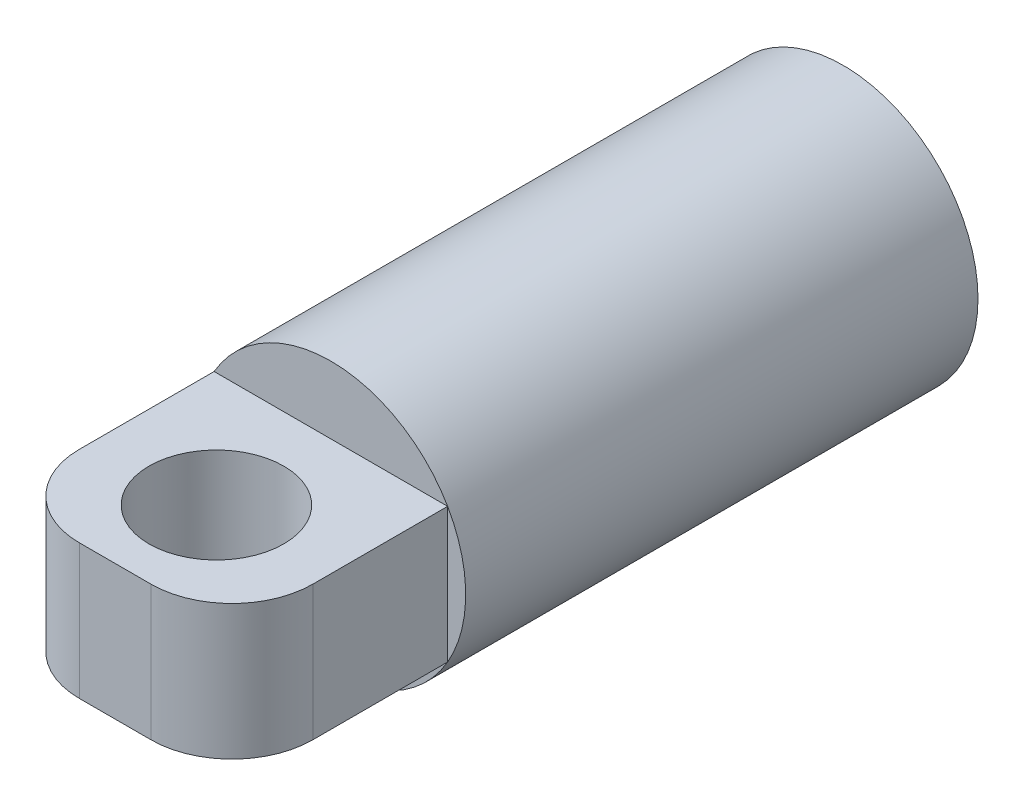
ISO-10303-21;
HEADER;
FILE_DESCRIPTION(('STEP AP214'),'2;1');
FILE_NAME('part.step','',(''),(''),'','','');
FILE_SCHEMA(('AUTOMOTIVE_DESIGN { 1 0 10303 214 1 1 1 1 }'));
ENDSEC;
DATA;
#1=APPLICATION_CONTEXT('core data for automotive mechanical design processes');
#2=APPLICATION_PROTOCOL_DEFINITION('international standard','automotive_design',2000,#1);
#3=PRODUCT_CONTEXT('',#1,'mechanical');
#4=PRODUCT('Part','Part','',(#3));
#5=PRODUCT_RELATED_PRODUCT_CATEGORY('part','',(#4));
#6=PRODUCT_DEFINITION_FORMATION('','',#4);
#7=PRODUCT_DEFINITION_CONTEXT('part definition',#1,'design');
#8=PRODUCT_DEFINITION('design','',#6,#7);
#9=PRODUCT_DEFINITION_SHAPE('','',#8);
#10=(LENGTH_UNIT() NAMED_UNIT(*) SI_UNIT(.MILLI.,.METRE.));
#11=(NAMED_UNIT(*) PLANE_ANGLE_UNIT() SI_UNIT($,.RADIAN.));
#12=(NAMED_UNIT(*) SI_UNIT($,.STERADIAN.) SOLID_ANGLE_UNIT());
#13=UNCERTAINTY_MEASURE_WITH_UNIT(LENGTH_MEASURE(1.E-05),#10,'distance_accuracy_value','');
#14=(GEOMETRIC_REPRESENTATION_CONTEXT(3) GLOBAL_UNCERTAINTY_ASSIGNED_CONTEXT((#13)) GLOBAL_UNIT_ASSIGNED_CONTEXT((#10,
#11,#12)) REPRESENTATION_CONTEXT('',''));
#15=CARTESIAN_POINT('',(0.,0.,0.));
#16=DIRECTION('',(0.,0.,1.));
#17=DIRECTION('',(1.,0.,0.));
#18=AXIS2_PLACEMENT_3D('',#15,#16,#17);
#19=CARTESIAN_POINT('',(0.,0.,27.));
#20=DIRECTION('',(0.,0.,-1.));
#21=DIRECTION('',(-1.,0.,0.));
#22=AXIS2_PLACEMENT_3D('',#19,#20,#21);
#23=CYLINDRICAL_SURFACE('',#22,5.);
#24=CARTESIAN_POINT('',(0.,0.,0.));
#25=DIRECTION('',(0.,0.,1.));
#26=DIRECTION('',(1.,0.,0.));
#27=AXIS2_PLACEMENT_3D('',#24,#25,#26);
#28=CIRCLE('',#27,5.);
#29=CARTESIAN_POINT('',(5.,0.,0.));
#30=VERTEX_POINT('',#29);
#31=EDGE_CURVE('E130',#30,#30,#28,.T.);
#32=ORIENTED_EDGE('',*,*,#31,.T.);
#33=EDGE_LOOP('',(#32));
#34=FACE_BOUND('',#33,.T.);
#35=CARTESIAN_POINT('',(0.,0.,19.));
#36=DIRECTION('',(0.,0.,1.));
#37=DIRECTION('',(1.,0.,0.));
#38=AXIS2_PLACEMENT_3D('',#35,#36,#37);
#39=CIRCLE('',#38,5.);
#40=CARTESIAN_POINT('',(4.33012701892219,2.5,19.));
#41=VERTEX_POINT('',#40);
#42=CARTESIAN_POINT('',(-4.33012701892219,2.5,19.));
#43=VERTEX_POINT('',#42);
#44=EDGE_CURVE('E98',#41,#43,#39,.T.);
#45=ORIENTED_EDGE('',*,*,#44,.F.);
#46=CARTESIAN_POINT('',(4.3301270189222,-2.5,19.));
#47=VERTEX_POINT('',#46);
#48=EDGE_CURVE('E90',#47,#41,#39,.T.);
#49=ORIENTED_EDGE('',*,*,#48,.F.);
#50=CARTESIAN_POINT('',(-4.33012701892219,-2.5,19.));
#51=VERTEX_POINT('',#50);
#52=EDGE_CURVE('E99',#51,#47,#39,.T.);
#53=ORIENTED_EDGE('',*,*,#52,.F.);
#54=EDGE_CURVE('E124',#43,#51,#39,.T.);
#55=ORIENTED_EDGE('',*,*,#54,.F.);
#56=EDGE_LOOP('',(#45,#49,#53,#55));
#57=FACE_BOUND('',#56,.T.);
#58=ADVANCED_FACE('F34',(#34,#57),#23,.T.);
#59=CARTESIAN_POINT('',(0.,0.,0.));
#60=DIRECTION('',(0.,0.,1.));
#61=DIRECTION('',(1.,0.,0.));
#62=AXIS2_PLACEMENT_3D('',#59,#60,#61);
#63=PLANE('',#62);
#64=ORIENTED_EDGE('',*,*,#31,.F.);
#65=EDGE_LOOP('',(#64));
#66=FACE_BOUND('',#65,.T.);
#67=ADVANCED_FACE('F173',(#66),#63,.F.);
#68=CARTESIAN_POINT('',(0.,0.,19.));
#69=DIRECTION('',(0.,0.,1.));
#70=DIRECTION('',(1.,0.,0.));
#71=AXIS2_PLACEMENT_3D('',#68,#69,#70);
#72=PLANE('',#71);
#73=ORIENTED_EDGE('',*,*,#44,.T.);
#74=DIRECTION('',(-1.,0.,0.));
#75=VECTOR('',#74,1.);
#76=CARTESIAN_POINT('',(-4.33012701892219,2.5,19.));
#77=LINE('',#76,#75);
#78=EDGE_CURVE('E108',#41,#43,#77,.T.);
#79=ORIENTED_EDGE('',*,*,#78,.F.);
#80=EDGE_LOOP('',(#73,#79));
#81=FACE_BOUND('',#80,.T.);
#82=ADVANCED_FACE('F115',(#81),#72,.T.);
#83=ORIENTED_EDGE('',*,*,#54,.T.);
#84=DIRECTION('',(0.,-1.,0.));
#85=VECTOR('',#84,1.);
#86=CARTESIAN_POINT('',(-4.33012701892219,-2.5,19.));
#87=LINE('',#86,#85);
#88=EDGE_CURVE('E117',#43,#51,#87,.T.);
#89=ORIENTED_EDGE('',*,*,#88,.F.);
#90=EDGE_LOOP('',(#83,#89));
#91=FACE_BOUND('',#90,.T.);
#92=ADVANCED_FACE('F260',(#91),#72,.T.);
#93=ORIENTED_EDGE('',*,*,#52,.T.);
#94=DIRECTION('',(1.,0.,0.));
#95=VECTOR('',#94,1.);
#96=CARTESIAN_POINT('',(-4.33012701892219,-2.5,19.));
#97=LINE('',#96,#95);
#98=EDGE_CURVE('E112',#51,#47,#97,.T.);
#99=ORIENTED_EDGE('',*,*,#98,.F.);
#100=EDGE_LOOP('',(#93,#99));
#101=FACE_BOUND('',#100,.T.);
#102=ADVANCED_FACE('F268',(#101),#72,.T.);
#103=ORIENTED_EDGE('',*,*,#48,.T.);
#104=DIRECTION('',(0.,1.,0.));
#105=VECTOR('',#104,1.);
#106=CARTESIAN_POINT('',(4.33012701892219,-2.5,19.));
#107=LINE('',#106,#105);
#108=EDGE_CURVE('E94',#47,#41,#107,.T.);
#109=ORIENTED_EDGE('',*,*,#108,.F.);
#110=EDGE_LOOP('',(#103,#109));
#111=FACE_BOUND('',#110,.T.);
#112=ADVANCED_FACE('F92',(#111),#72,.T.);
#113=CARTESIAN_POINT('',(4.33012701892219,-2.5,19.));
#114=DIRECTION('',(1.,0.,0.));
#115=DIRECTION('',(0.,0.,-1.));
#116=AXIS2_PLACEMENT_3D('',#113,#114,#115);
#117=PLANE('',#116);
#118=DIRECTION('',(0.,0.,1.));
#119=VECTOR('',#118,1.);
#120=CARTESIAN_POINT('',(4.33012701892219,2.5,19.));
#121=LINE('',#120,#119);
#122=CARTESIAN_POINT('',(4.33012701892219,2.5,24.));
#123=VERTEX_POINT('',#122);
#124=EDGE_CURVE('E103',#41,#123,#121,.T.);
#125=ORIENTED_EDGE('',*,*,#124,.T.);
#126=DIRECTION('',(0.,1.,0.));
#127=VECTOR('',#126,1.);
#128=CARTESIAN_POINT('',(4.33012701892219,-2.5,24.));
#129=LINE('',#128,#127);
#130=CARTESIAN_POINT('',(4.33012701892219,-2.5,24.));
#131=VERTEX_POINT('',#130);
#132=EDGE_CURVE('E58',#123,#131,#129,.F.);
#133=ORIENTED_EDGE('',*,*,#132,.T.);
#134=DIRECTION('',(0.,0.,1.));
#135=VECTOR('',#134,1.);
#136=CARTESIAN_POINT('',(4.33012701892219,-2.5,19.));
#137=LINE('',#136,#135);
#138=EDGE_CURVE('E120',#47,#131,#137,.T.);
#139=ORIENTED_EDGE('',*,*,#138,.F.);
#140=ORIENTED_EDGE('',*,*,#108,.T.);
#141=EDGE_LOOP('',(#125,#133,#139,#140));
#142=FACE_BOUND('',#141,.T.);
#143=ADVANCED_FACE('F119',(#142),#117,.T.);
#144=CARTESIAN_POINT('',(-4.33012701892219,-2.5,19.));
#145=DIRECTION('',(0.,-1.,0.));
#146=DIRECTION('',(0.,0.,-1.));
#147=AXIS2_PLACEMENT_3D('',#144,#145,#146);
#148=PLANE('',#147);
#149=CARTESIAN_POINT('',(0.,-2.5,23.2450882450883));
#150=DIRECTION('',(0.,-1.,0.));
#151=DIRECTION('',(0.,0.,-1.));
#152=AXIS2_PLACEMENT_3D('',#149,#150,#151);
#153=CIRCLE('',#152,2.5);
#154=CARTESIAN_POINT('',(0.,-2.5,20.7450882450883));
#155=VERTEX_POINT('',#154);
#156=EDGE_CURVE('E148',#155,#155,#153,.T.);
#157=ORIENTED_EDGE('',*,*,#156,.F.);
#158=EDGE_LOOP('',(#157));
#159=FACE_BOUND('',#158,.T.);
#160=ORIENTED_EDGE('',*,*,#138,.T.);
#161=CARTESIAN_POINT('',(1.33012701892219,-2.5,24.));
#162=DIRECTION('',(0.,-1.,0.));
#163=DIRECTION('',(0.,0.,-1.));
#164=AXIS2_PLACEMENT_3D('',#161,#162,#163);
#165=CIRCLE('',#164,3.);
#166=CARTESIAN_POINT('',(1.33012701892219,-2.5,27.));
#167=VERTEX_POINT('',#166);
#168=EDGE_CURVE('E43',#131,#167,#165,.T.);
#169=ORIENTED_EDGE('',*,*,#168,.T.);
#170=DIRECTION('',(1.,0.,0.));
#171=VECTOR('',#170,1.);
#172=CARTESIAN_POINT('',(-4.33012701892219,-2.5,27.));
#173=LINE('',#172,#171);
#174=CARTESIAN_POINT('',(-1.33012701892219,-2.5,27.));
#175=VERTEX_POINT('',#174);
#176=EDGE_CURVE('E122',#175,#167,#173,.T.);
#177=ORIENTED_EDGE('',*,*,#176,.F.);
#178=CARTESIAN_POINT('',(-1.33012701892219,-2.5,24.));
#179=DIRECTION('',(0.,-1.,0.));
#180=DIRECTION('',(0.,0.,-1.));
#181=AXIS2_PLACEMENT_3D('',#178,#179,#180);
#182=CIRCLE('',#181,3.);
#183=CARTESIAN_POINT('',(-4.33012701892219,-2.5,24.));
#184=VERTEX_POINT('',#183);
#185=EDGE_CURVE('E50',#175,#184,#182,.T.);
#186=ORIENTED_EDGE('',*,*,#185,.T.);
#187=DIRECTION('',(0.,0.,1.));
#188=VECTOR('',#187,1.);
#189=CARTESIAN_POINT('',(-4.33012701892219,-2.5,19.));
#190=LINE('',#189,#188);
#191=EDGE_CURVE('E135',#51,#184,#190,.T.);
#192=ORIENTED_EDGE('',*,*,#191,.F.);
#193=ORIENTED_EDGE('',*,*,#98,.T.);
#194=EDGE_LOOP('',(#160,#169,#177,#186,#192,#193));
#195=FACE_BOUND('',#194,.T.);
#196=ADVANCED_FACE('F168',(#159,#195),#148,.T.);
#197=CARTESIAN_POINT('',(-4.33012701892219,-2.5,19.));
#198=DIRECTION('',(-1.,0.,0.));
#199=DIRECTION('',(0.,0.,1.));
#200=AXIS2_PLACEMENT_3D('',#197,#198,#199);
#201=PLANE('',#200);
#202=ORIENTED_EDGE('',*,*,#191,.T.);
#203=DIRECTION('',(0.,-1.,0.));
#204=VECTOR('',#203,1.);
#205=CARTESIAN_POINT('',(-4.33012701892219,-2.5,24.));
#206=LINE('',#205,#204);
#207=CARTESIAN_POINT('',(-4.33012701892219,2.5,24.));
#208=VERTEX_POINT('',#207);
#209=EDGE_CURVE('E12',#184,#208,#206,.F.);
#210=ORIENTED_EDGE('',*,*,#209,.T.);
#211=DIRECTION('',(0.,0.,1.));
#212=VECTOR('',#211,1.);
#213=CARTESIAN_POINT('',(-4.33012701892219,2.5,19.));
#214=LINE('',#213,#212);
#215=EDGE_CURVE('E111',#43,#208,#214,.T.);
#216=ORIENTED_EDGE('',*,*,#215,.F.);
#217=ORIENTED_EDGE('',*,*,#88,.T.);
#218=EDGE_LOOP('',(#202,#210,#216,#217));
#219=FACE_BOUND('',#218,.T.);
#220=ADVANCED_FACE('F159',(#219),#201,.T.);
#221=CARTESIAN_POINT('',(-4.33012701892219,2.5,19.));
#222=DIRECTION('',(0.,1.,0.));
#223=DIRECTION('',(0.,0.,1.));
#224=AXIS2_PLACEMENT_3D('',#221,#222,#223);
#225=PLANE('',#224);
#226=CARTESIAN_POINT('',(0.,2.5,23.2450882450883));
#227=DIRECTION('',(0.,1.,0.));
#228=DIRECTION('',(0.,0.,1.));
#229=AXIS2_PLACEMENT_3D('',#226,#227,#228);
#230=CIRCLE('',#229,2.5);
#231=CARTESIAN_POINT('',(0.,2.5,25.7450882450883));
#232=VERTEX_POINT('',#231);
#233=EDGE_CURVE('E38',#232,#232,#230,.T.);
#234=ORIENTED_EDGE('',*,*,#233,.F.);
#235=EDGE_LOOP('',(#234));
#236=FACE_BOUND('',#235,.T.);
#237=DIRECTION('',(-1.,0.,0.));
#238=VECTOR('',#237,1.);
#239=CARTESIAN_POINT('',(-4.33012701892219,2.5,27.));
#240=LINE('',#239,#238);
#241=CARTESIAN_POINT('',(1.33012701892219,2.5,27.));
#242=VERTEX_POINT('',#241);
#243=CARTESIAN_POINT('',(-1.33012701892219,2.5,27.));
#244=VERTEX_POINT('',#243);
#245=EDGE_CURVE('E142',#242,#244,#240,.T.);
#246=ORIENTED_EDGE('',*,*,#245,.F.);
#247=CARTESIAN_POINT('',(1.33012701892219,2.5,24.));
#248=DIRECTION('',(0.,1.,0.));
#249=DIRECTION('',(0.,0.,1.));
#250=AXIS2_PLACEMENT_3D('',#247,#248,#249);
#251=CIRCLE('',#250,3.);
#252=EDGE_CURVE('E110',#242,#123,#251,.T.);
#253=ORIENTED_EDGE('',*,*,#252,.T.);
#254=ORIENTED_EDGE('',*,*,#124,.F.);
#255=ORIENTED_EDGE('',*,*,#78,.T.);
#256=ORIENTED_EDGE('',*,*,#215,.T.);
#257=CARTESIAN_POINT('',(-1.33012701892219,2.5,24.));
#258=DIRECTION('',(0.,1.,0.));
#259=DIRECTION('',(0.,0.,1.));
#260=AXIS2_PLACEMENT_3D('',#257,#258,#259);
#261=CIRCLE('',#260,3.);
#262=EDGE_CURVE('E194',#208,#244,#261,.T.);
#263=ORIENTED_EDGE('',*,*,#262,.T.);
#264=EDGE_LOOP('',(#246,#253,#254,#255,#256,#263));
#265=FACE_BOUND('',#264,.T.);
#266=ADVANCED_FACE('F106',(#236,#265),#225,.T.);
#267=CARTESIAN_POINT('',(0.,0.,27.));
#268=DIRECTION('',(0.,0.,1.));
#269=DIRECTION('',(1.,0.,0.));
#270=AXIS2_PLACEMENT_3D('',#267,#268,#269);
#271=PLANE('',#270);
#272=ORIENTED_EDGE('',*,*,#176,.T.);
#273=DIRECTION('',(0.,1.,0.));
#274=VECTOR('',#273,1.);
#275=CARTESIAN_POINT('',(1.33012701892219,0.,27.));
#276=LINE('',#275,#274);
#277=EDGE_CURVE('E127',#167,#242,#276,.T.);
#278=ORIENTED_EDGE('',*,*,#277,.T.);
#279=ORIENTED_EDGE('',*,*,#245,.T.);
#280=DIRECTION('',(0.,-1.,0.));
#281=VECTOR('',#280,1.);
#282=CARTESIAN_POINT('',(-1.33012701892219,0.,27.));
#283=LINE('',#282,#281);
#284=EDGE_CURVE('E125',#244,#175,#283,.T.);
#285=ORIENTED_EDGE('',*,*,#284,.T.);
#286=EDGE_LOOP('',(#272,#278,#279,#285));
#287=FACE_BOUND('',#286,.T.);
#288=ADVANCED_FACE('F158',(#287),#271,.T.);
#289=CARTESIAN_POINT('',(1.33012701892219,0.,24.));
#290=DIRECTION('',(0.,1.,0.));
#291=DIRECTION('',(0.,0.,1.));
#292=AXIS2_PLACEMENT_3D('',#289,#290,#291);
#293=CYLINDRICAL_SURFACE('',#292,3.);
#294=ORIENTED_EDGE('',*,*,#168,.F.);
#295=ORIENTED_EDGE('',*,*,#132,.F.);
#296=ORIENTED_EDGE('',*,*,#252,.F.);
#297=ORIENTED_EDGE('',*,*,#277,.F.);
#298=EDGE_LOOP('',(#294,#295,#296,#297));
#299=FACE_BOUND('',#298,.T.);
#300=ADVANCED_FACE('F165',(#299),#293,.T.);
#301=CARTESIAN_POINT('',(-1.33012701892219,0.,24.));
#302=DIRECTION('',(0.,-1.,0.));
#303=DIRECTION('',(0.,0.,-1.));
#304=AXIS2_PLACEMENT_3D('',#301,#302,#303);
#305=CYLINDRICAL_SURFACE('',#304,3.);
#306=ORIENTED_EDGE('',*,*,#262,.F.);
#307=ORIENTED_EDGE('',*,*,#209,.F.);
#308=ORIENTED_EDGE('',*,*,#185,.F.);
#309=ORIENTED_EDGE('',*,*,#284,.F.);
#310=EDGE_LOOP('',(#306,#307,#308,#309));
#311=FACE_BOUND('',#310,.T.);
#312=ADVANCED_FACE('F36',(#311),#305,.T.);
#313=CARTESIAN_POINT('',(0.,5.5,23.2450882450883));
#314=DIRECTION('',(0.,-1.,0.));
#315=DIRECTION('',(0.,0.,-1.));
#316=AXIS2_PLACEMENT_3D('',#313,#314,#315);
#317=CYLINDRICAL_SURFACE('',#316,2.5);
#318=ORIENTED_EDGE('',*,*,#233,.T.);
#319=EDGE_LOOP('',(#318));
#320=FACE_BOUND('',#319,.T.);
#321=ORIENTED_EDGE('',*,*,#156,.T.);
#322=EDGE_LOOP('',(#321));
#323=FACE_BOUND('',#322,.T.);
#324=ADVANCED_FACE('F155',(#320,#323),#317,.F.);
#325=CLOSED_SHELL('',(#58,#67,#82,#92,#102,#112,#143,#196,#220,#266,#288,#300,#312,#324));
#326=MANIFOLD_SOLID_BREP('B2',#325);
#327=ADVANCED_BREP_SHAPE_REPRESENTATION('',(#18,#326),#14);
#328=SHAPE_DEFINITION_REPRESENTATION(#9,#327);
ENDSEC;
END-ISO-10303-21;
